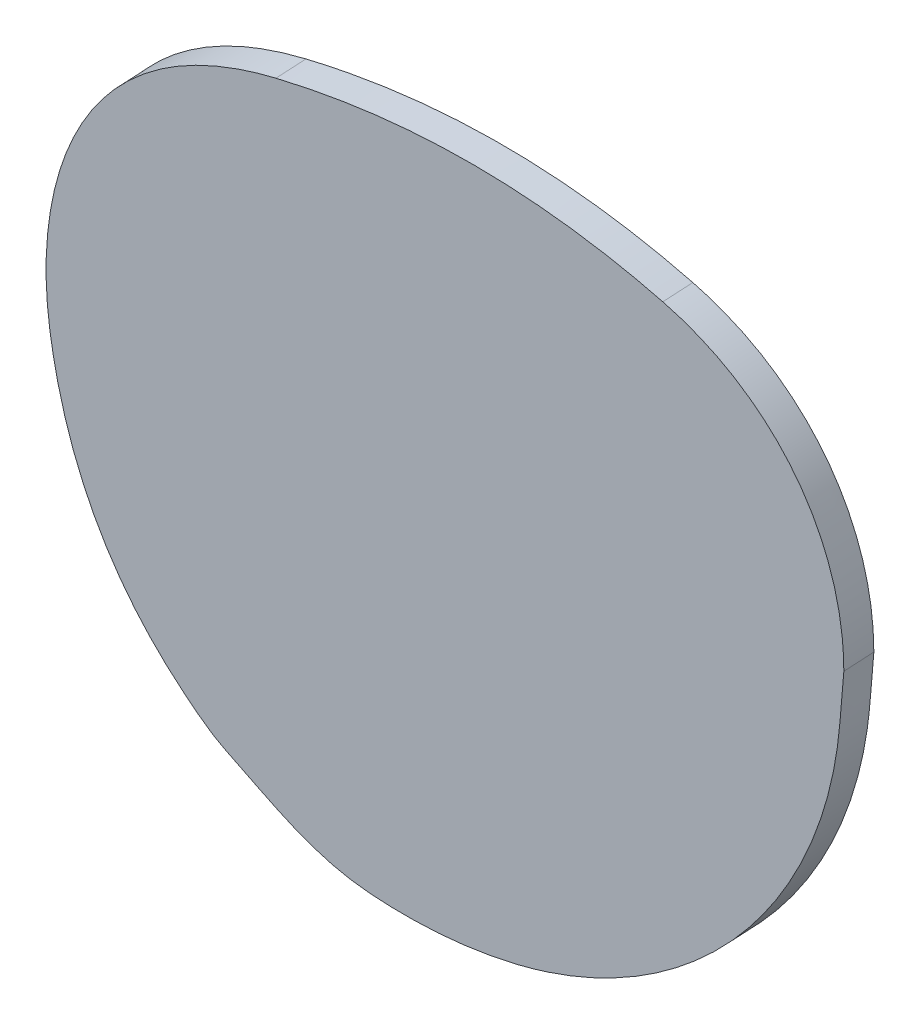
ISO-10303-21;
HEADER;
FILE_DESCRIPTION(('STEP AP214'),'2;1');
FILE_NAME('part.step','',(''),(''),'','','');
FILE_SCHEMA(('AUTOMOTIVE_DESIGN { 1 0 10303 214 1 1 1 1 }'));
ENDSEC;
DATA;
#1=APPLICATION_CONTEXT('core data for automotive mechanical design processes');
#2=APPLICATION_PROTOCOL_DEFINITION('international standard','automotive_design',2000,#1);
#3=PRODUCT_CONTEXT('',#1,'mechanical');
#4=PRODUCT('Part','Part','',(#3));
#5=PRODUCT_RELATED_PRODUCT_CATEGORY('part','',(#4));
#6=PRODUCT_DEFINITION_FORMATION('','',#4);
#7=PRODUCT_DEFINITION_CONTEXT('part definition',#1,'design');
#8=PRODUCT_DEFINITION('design','',#6,#7);
#9=PRODUCT_DEFINITION_SHAPE('','',#8);
#10=(LENGTH_UNIT() NAMED_UNIT(*) SI_UNIT(.MILLI.,.METRE.));
#11=(NAMED_UNIT(*) PLANE_ANGLE_UNIT() SI_UNIT($,.RADIAN.));
#12=(NAMED_UNIT(*) SI_UNIT($,.STERADIAN.) SOLID_ANGLE_UNIT());
#13=UNCERTAINTY_MEASURE_WITH_UNIT(LENGTH_MEASURE(1.E-05),#10,'distance_accuracy_value','');
#14=(GEOMETRIC_REPRESENTATION_CONTEXT(3) GLOBAL_UNCERTAINTY_ASSIGNED_CONTEXT((#13)) GLOBAL_UNIT_ASSIGNED_CONTEXT((#10,
#11,#12)) REPRESENTATION_CONTEXT('',''));
#15=CARTESIAN_POINT('',(0.,0.,0.));
#16=DIRECTION('',(0.,0.,1.));
#17=DIRECTION('',(1.,0.,0.));
#18=AXIS2_PLACEMENT_3D('',#15,#16,#17);
#19=CARTESIAN_POINT('',(7.15506768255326,38.680254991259,26.2106371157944));
#20=CARTESIAN_POINT('',(7.09653088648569,37.956999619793,26.2137048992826));
#21=CARTESIAN_POINT('',(7.04234312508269,37.2333962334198,26.2165447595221));
#22=CARTESIAN_POINT('',(6.92411421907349,35.786978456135,26.2227408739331));
#23=CARTESIAN_POINT('',(6.86452619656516,35.0631730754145,26.2258637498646));
#24=CARTESIAN_POINT('',(6.57291700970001,32.9069414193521,26.2411463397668));
#25=CARTESIAN_POINT('',(6.25309264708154,31.4881477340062,26.2579076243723));
#26=CARTESIAN_POINT('',(5.59562292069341,29.4207714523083,26.2923641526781));
#27=CARTESIAN_POINT('',(5.34564417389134,28.7382950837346,26.305464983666));
#28=CARTESIAN_POINT('',(4.79035545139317,27.4031020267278,26.3345664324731));
#29=CARTESIAN_POINT('',(4.48580010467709,26.7515285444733,26.3505275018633));
#30=CARTESIAN_POINT('',(3.493626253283,24.8435523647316,26.4025251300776));
#31=CARTESIAN_POINT('',(2.72815598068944,23.6335033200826,26.4426417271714));
#32=CARTESIAN_POINT('',(1.42096257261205,21.9130926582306,26.5111488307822));
#33=CARTESIAN_POINT('',(0.956286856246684,21.3532075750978,26.5355014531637));
#34=CARTESIAN_POINT('',(-0.0125046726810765,20.2840696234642,26.586273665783));
#35=CARTESIAN_POINT('',(-0.517345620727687,19.7733771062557,26.6127312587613));
#36=CARTESIAN_POINT('',(-2.09257338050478,18.3121924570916,26.6952854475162));
#37=CARTESIAN_POINT('',(-3.22313174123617,17.4319703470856,26.7545355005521));
#38=CARTESIAN_POINT('',(-4.74258388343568,16.4557793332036,26.8341666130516));
#39=CARTESIAN_POINT('',(-5.05258095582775,16.2663866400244,26.8504128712));
#40=CARTESIAN_POINT('',(-5.6779309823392,15.9036736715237,26.883186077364));
#41=CARTESIAN_POINT('',(-5.99364758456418,15.7300712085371,26.8997320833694));
#42=CARTESIAN_POINT('',(-6.94982901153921,15.2322884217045,26.9498434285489));
#43=CARTESIAN_POINT('',(-7.59930948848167,14.9310919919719,26.9838812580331));
#44=CARTESIAN_POINT('',(-9.58369493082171,14.1191359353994,27.0878784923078));
#45=CARTESIAN_POINT('',(-10.9542978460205,13.6993822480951,27.1597087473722));
#46=CARTESIAN_POINT('',(-12.3752312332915,13.4079376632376,27.2341767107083));
#47=B_SPLINE_CURVE_WITH_KNOTS('',3,(#19,#20,#21,#22,#23,#24,#25,#26,#27,#28,#29,#30,#31,#32,#33,
#34,#35,#36,#37,#38,#39,#40,#41,#42,#43,#44,#45,#46),.UNSPECIFIED.,.F.,.F.,(4,2,2,2,2,2,2,2,2,2,
2,2,2,4),(0.,0.0624999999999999,0.125,0.25,0.3125,0.375,0.5,0.5625,0.625,0.75,0.78125,0.8125,
0.875,1.),.UNSPECIFIED.);
#48=DIRECTION('',(0.0523359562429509,0.,0.998629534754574));
#49=VECTOR('',#48,1.);
#50=SURFACE_OF_LINEAR_EXTRUSION('',#47,#49);
#51=CARTESIAN_POINT('',(7.25973959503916,38.6802549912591,28.2078961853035));
#52=CARTESIAN_POINT('',(7.20120279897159,37.956999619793,28.2109639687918));
#53=CARTESIAN_POINT('',(7.14701503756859,37.2333962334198,28.2138038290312));
#54=CARTESIAN_POINT('',(7.02878613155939,35.786978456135,28.2199999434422));
#55=CARTESIAN_POINT('',(6.96919810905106,35.0631730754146,28.2231228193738));
#56=CARTESIAN_POINT('',(6.67758892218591,32.9069414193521,28.238405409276));
#57=CARTESIAN_POINT('',(6.35776455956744,31.4881477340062,28.2551666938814));
#58=CARTESIAN_POINT('',(5.70029483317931,29.4207714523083,28.2896232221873));
#59=CARTESIAN_POINT('',(5.45031608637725,28.7382950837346,28.3027240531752));
#60=CARTESIAN_POINT('',(4.89502736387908,27.4031020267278,28.3318255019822));
#61=CARTESIAN_POINT('',(4.59047201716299,26.7515285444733,28.3477865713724));
#62=CARTESIAN_POINT('',(3.5982981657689,24.8435523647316,28.3997841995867));
#63=CARTESIAN_POINT('',(2.83282789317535,23.6335033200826,28.4399007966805));
#64=CARTESIAN_POINT('',(1.52563448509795,21.9130926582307,28.5084079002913));
#65=CARTESIAN_POINT('',(1.06095876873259,21.3532075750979,28.5327605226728));
#66=CARTESIAN_POINT('',(0.0921672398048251,20.2840696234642,28.5835327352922));
#67=CARTESIAN_POINT('',(-0.412673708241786,19.7733771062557,28.6099903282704));
#68=CARTESIAN_POINT('',(-1.98790146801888,18.3121924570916,28.6925445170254));
#69=CARTESIAN_POINT('',(-3.11845982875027,17.4319703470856,28.7517945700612));
#70=CARTESIAN_POINT('',(-4.63791197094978,16.4557793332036,28.8314256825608));
#71=CARTESIAN_POINT('',(-4.94790904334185,16.2663866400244,28.8476719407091));
#72=CARTESIAN_POINT('',(-5.5732590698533,15.9036736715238,28.8804451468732));
#73=CARTESIAN_POINT('',(-5.88897567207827,15.7300712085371,28.8969911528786));
#74=CARTESIAN_POINT('',(-6.84515709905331,15.2322884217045,28.947102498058));
#75=CARTESIAN_POINT('',(-7.49463757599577,14.9310919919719,28.9811403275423));
#76=CARTESIAN_POINT('',(-9.4790230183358,14.1191359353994,29.0851375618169));
#77=CARTESIAN_POINT('',(-10.8496259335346,13.6993822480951,29.1569678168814));
#78=CARTESIAN_POINT('',(-12.2705593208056,13.4079376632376,29.2314357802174));
#79=B_SPLINE_CURVE_WITH_KNOTS('',3,(#51,#52,#53,#54,#55,#56,#57,#58,#59,#60,#61,#62,#63,#64,#65,
#66,#67,#68,#69,#70,#71,#72,#73,#74,#75,#76,#77,#78),.UNSPECIFIED.,.F.,.F.,(4,2,2,2,2,2,2,2,2,2,
2,2,2,4),(0.,0.0624999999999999,0.125,0.25,0.3125,0.375,0.5,0.5625,0.625,0.75,0.78125,0.8125,
0.875,1.),.UNSPECIFIED.);
#80=CARTESIAN_POINT('',(7.25973959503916,38.680254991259,28.2078961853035));
#81=VERTEX_POINT('',#80);
#82=CARTESIAN_POINT('',(-12.2705608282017,13.4079373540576,29.2314358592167));
#83=VERTEX_POINT('',#82);
#84=EDGE_CURVE('E384',#81,#83,#79,.T.);
#85=ORIENTED_EDGE('',*,*,#84,.T.);
#86=DIRECTION('',(0.0523359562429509,0.,0.998629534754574));
#87=VECTOR('',#86,1.);
#88=CARTESIAN_POINT('',(-12.3752327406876,13.4079373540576,27.2341767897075));
#89=LINE('',#88,#87);
#90=CARTESIAN_POINT('',(-12.3752327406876,13.4079373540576,27.2341767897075));
#91=VERTEX_POINT('',#90);
#92=EDGE_CURVE('E11',#91,#83,#89,.T.);
#93=ORIENTED_EDGE('',*,*,#92,.F.);
#94=CARTESIAN_POINT('',(-12.3752312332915,13.4079376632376,27.2341767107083));
#95=CARTESIAN_POINT('',(-10.9542978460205,13.6993822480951,27.1597087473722));
#96=CARTESIAN_POINT('',(-9.58369493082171,14.1191359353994,27.0878784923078));
#97=CARTESIAN_POINT('',(-7.59930948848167,14.9310919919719,26.9838812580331));
#98=CARTESIAN_POINT('',(-6.94982901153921,15.2322884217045,26.9498434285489));
#99=CARTESIAN_POINT('',(-5.99364758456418,15.7300712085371,26.8997320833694));
#100=CARTESIAN_POINT('',(-5.6779309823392,15.9036736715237,26.883186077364));
#101=CARTESIAN_POINT('',(-5.05258095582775,16.2663866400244,26.8504128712));
#102=CARTESIAN_POINT('',(-4.74258388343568,16.4557793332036,26.8341666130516));
#103=CARTESIAN_POINT('',(-3.22313174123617,17.4319703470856,26.7545355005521));
#104=CARTESIAN_POINT('',(-2.09257338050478,18.3121924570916,26.6952854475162));
#105=CARTESIAN_POINT('',(-0.517345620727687,19.7733771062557,26.6127312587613));
#106=CARTESIAN_POINT('',(-0.0125046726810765,20.2840696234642,26.586273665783));
#107=CARTESIAN_POINT('',(0.956286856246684,21.3532075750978,26.5355014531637));
#108=CARTESIAN_POINT('',(1.42096257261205,21.9130926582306,26.5111488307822));
#109=CARTESIAN_POINT('',(2.72815598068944,23.6335033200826,26.4426417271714));
#110=CARTESIAN_POINT('',(3.493626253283,24.8435523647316,26.4025251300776));
#111=CARTESIAN_POINT('',(4.48580010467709,26.7515285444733,26.3505275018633));
#112=CARTESIAN_POINT('',(4.79035545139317,27.4031020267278,26.3345664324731));
#113=CARTESIAN_POINT('',(5.34564417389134,28.7382950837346,26.305464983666));
#114=CARTESIAN_POINT('',(5.59562292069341,29.4207714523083,26.2923641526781));
#115=CARTESIAN_POINT('',(6.25309264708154,31.4881477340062,26.2579076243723));
#116=CARTESIAN_POINT('',(6.57291700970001,32.9069414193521,26.2411463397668));
#117=CARTESIAN_POINT('',(6.86452619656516,35.0631730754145,26.2258637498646));
#118=CARTESIAN_POINT('',(6.92411421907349,35.786978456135,26.2227408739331));
#119=CARTESIAN_POINT('',(7.04234312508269,37.2333962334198,26.2165447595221));
#120=CARTESIAN_POINT('',(7.09653088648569,37.956999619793,26.2137048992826));
#121=CARTESIAN_POINT('',(7.15506768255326,38.680254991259,26.2106371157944));
#122=B_SPLINE_CURVE_WITH_KNOTS('',3,(#94,#95,#96,#97,#98,#99,#100,#101,#102,#103,#104,#105,#106,
#107,#108,#109,#110,#111,#112,#113,#114,#115,#116,#117,#118,#119,#120,#121),.UNSPECIFIED.,.F.,
.F.,(4,2,2,2,2,2,2,2,2,2,2,2,2,4),(0.,0.125,0.1875,0.21875,0.25,0.375,0.4375,0.5,0.625,0.6875,
0.75,0.875,0.9375,1.),.UNSPECIFIED.);
#123=CARTESIAN_POINT('',(7.15506768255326,38.680254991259,26.2106371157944));
#124=VERTEX_POINT('',#123);
#125=EDGE_CURVE('E409',#124,#91,#122,.F.);
#126=ORIENTED_EDGE('',*,*,#125,.F.);
#127=DIRECTION('',(0.0523359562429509,0.,0.998629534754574));
#128=VECTOR('',#127,1.);
#129=CARTESIAN_POINT('',(7.15506768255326,38.680254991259,26.2106371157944));
#130=LINE('',#129,#128);
#131=EDGE_CURVE('E346',#124,#81,#130,.T.);
#132=ORIENTED_EDGE('',*,*,#131,.T.);
#133=EDGE_LOOP('',(#85,#93,#126,#132));
#134=FACE_BOUND('',#133,.T.);
#135=ADVANCED_FACE('F45',(#134),#50,.F.);
#136=CARTESIAN_POINT('',(-12.3752327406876,13.4079373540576,27.2341767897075));
#137=CARTESIAN_POINT('',(-13.83316348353,13.1089019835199,27.3105837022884));
#138=CARTESIAN_POINT('',(-15.309564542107,12.9358962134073,27.3879586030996));
#139=CARTESIAN_POINT('',(-18.2821948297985,12.8341997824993,27.543747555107));
#140=CARTESIAN_POINT('',(-19.7713232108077,12.9064233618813,27.6217894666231));
#141=CARTESIAN_POINT('',(-21.246541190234,13.102112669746,27.6991023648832));
#142=B_SPLINE_CURVE_WITH_KNOTS('',3,(#136,#137,#138,#139,#140,#141),.UNSPECIFIED.,.F.,.F.,(4,2,
4),(0.,0.5,1.),.UNSPECIFIED.);
#143=DIRECTION('',(0.0523359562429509,0.,0.998629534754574));
#144=VECTOR('',#143,1.);
#145=SURFACE_OF_LINEAR_EXTRUSION('',#142,#144);
#146=CARTESIAN_POINT('',(-12.2705608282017,13.4079373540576,29.2314358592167));
#147=CARTESIAN_POINT('',(-13.7284915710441,13.1089019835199,29.3078427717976));
#148=CARTESIAN_POINT('',(-15.2048926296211,12.9358962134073,29.3852176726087));
#149=CARTESIAN_POINT('',(-18.1775229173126,12.8341997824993,29.5410066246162));
#150=CARTESIAN_POINT('',(-19.6666512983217,12.9064233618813,29.6190485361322));
#151=CARTESIAN_POINT('',(-21.1418692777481,13.1021126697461,29.6963614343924));
#152=B_SPLINE_CURVE_WITH_KNOTS('',3,(#146,#147,#148,#149,#150,#151),.UNSPECIFIED.,.F.,.F.,(4,2,
4),(0.,0.5,1.),.UNSPECIFIED.);
#153=CARTESIAN_POINT('',(-21.1418700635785,13.102112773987,29.696361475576));
#154=VERTEX_POINT('',#153);
#155=EDGE_CURVE('E378',#83,#154,#152,.T.);
#156=ORIENTED_EDGE('',*,*,#155,.T.);
#157=DIRECTION('',(0.0523359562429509,0.,0.998629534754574));
#158=VECTOR('',#157,1.);
#159=CARTESIAN_POINT('',(-21.2465419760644,13.102112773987,27.6991024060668));
#160=LINE('',#159,#158);
#161=CARTESIAN_POINT('',(-21.2465419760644,13.102112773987,27.6991024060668));
#162=VERTEX_POINT('',#161);
#163=EDGE_CURVE('E59',#162,#154,#160,.T.);
#164=ORIENTED_EDGE('',*,*,#163,.F.);
#165=CARTESIAN_POINT('',(-21.246541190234,13.102112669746,27.6991023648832));
#166=CARTESIAN_POINT('',(-19.7713232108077,12.9064233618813,27.6217894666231));
#167=CARTESIAN_POINT('',(-18.2821948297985,12.8341997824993,27.543747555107));
#168=CARTESIAN_POINT('',(-15.309564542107,12.9358962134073,27.3879586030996));
#169=CARTESIAN_POINT('',(-13.83316348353,13.1089019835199,27.3105837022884));
#170=CARTESIAN_POINT('',(-12.3752327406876,13.4079373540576,27.2341767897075));
#171=B_SPLINE_CURVE_WITH_KNOTS('',3,(#165,#166,#167,#168,#169,#170),.UNSPECIFIED.,.F.,.F.,(4,2,
4),(0.,0.5,1.),.UNSPECIFIED.);
#172=EDGE_CURVE('E114',#91,#162,#171,.F.);
#173=ORIENTED_EDGE('',*,*,#172,.F.);
#174=ORIENTED_EDGE('',*,*,#92,.T.);
#175=EDGE_LOOP('',(#156,#164,#173,#174));
#176=FACE_BOUND('',#175,.T.);
#177=ADVANCED_FACE('F251',(#176),#145,.F.);
#178=CARTESIAN_POINT('',(-21.2465419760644,13.102112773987,27.6991024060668));
#179=CARTESIAN_POINT('',(-22.0384614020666,13.2071611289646,27.7406051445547));
#180=CARTESIAN_POINT('',(-22.8102589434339,13.3834656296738,27.7810533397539));
#181=CARTESIAN_POINT('',(-24.3161496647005,13.8695943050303,27.8599737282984));
#182=CARTESIAN_POINT('',(-25.0528569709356,14.1808648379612,27.8985829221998));
#183=CARTESIAN_POINT('',(-26.483225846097,14.8811720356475,27.9735453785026));
#184=CARTESIAN_POINT('',(-27.1793045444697,15.2692950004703,28.0100253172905));
#185=CARTESIAN_POINT('',(-28.5618275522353,16.0626473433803,28.0824802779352));
#186=CARTESIAN_POINT('',(-29.2484362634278,16.4674482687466,28.1184639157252));
#187=CARTESIAN_POINT('',(-29.9432760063,16.8578760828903,28.1548789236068));
#188=B_SPLINE_CURVE_WITH_KNOTS('',3,(#178,#179,#180,#181,#182,#183,#184,#185,#186,#187),
.UNSPECIFIED.,.F.,.F.,(4,2,2,2,4),(0.,0.25,0.5,0.75,1.),.UNSPECIFIED.);
#189=DIRECTION('',(0.0523359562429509,0.,0.998629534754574));
#190=VECTOR('',#189,1.);
#191=SURFACE_OF_LINEAR_EXTRUSION('',#188,#190);
#192=CARTESIAN_POINT('',(-21.1418700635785,13.102112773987,29.696361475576));
#193=CARTESIAN_POINT('',(-21.9337894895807,13.2071611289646,29.7378642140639));
#194=CARTESIAN_POINT('',(-22.705587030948,13.3834656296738,29.778312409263));
#195=CARTESIAN_POINT('',(-24.2114777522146,13.8695943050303,29.8572327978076));
#196=CARTESIAN_POINT('',(-24.9481850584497,14.1808648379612,29.8958419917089));
#197=CARTESIAN_POINT('',(-26.3785539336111,14.8811720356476,29.9708044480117));
#198=CARTESIAN_POINT('',(-27.0746326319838,15.2692950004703,30.0072843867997));
#199=CARTESIAN_POINT('',(-28.4571556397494,16.0626473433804,30.0797393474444));
#200=CARTESIAN_POINT('',(-29.1437643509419,16.4674482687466,30.1157229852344));
#201=CARTESIAN_POINT('',(-29.8386040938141,16.8578760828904,30.1521379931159));
#202=B_SPLINE_CURVE_WITH_KNOTS('',3,(#192,#193,#194,#195,#196,#197,#198,#199,#200,#201),
.UNSPECIFIED.,.F.,.F.,(4,2,2,2,4),(0.,0.25,0.5,0.75,1.),.UNSPECIFIED.);
#203=CARTESIAN_POINT('',(-29.8386040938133,16.8578760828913,30.1521379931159));
#204=VERTEX_POINT('',#203);
#205=EDGE_CURVE('E337',#154,#204,#202,.T.);
#206=ORIENTED_EDGE('',*,*,#205,.T.);
#207=DIRECTION('',(0.0523359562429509,0.,0.998629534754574));
#208=VECTOR('',#207,1.);
#209=CARTESIAN_POINT('',(-29.9432760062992,16.8578760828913,28.1548789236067));
#210=LINE('',#209,#208);
#211=CARTESIAN_POINT('',(-29.9432760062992,16.8578760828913,28.1548789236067));
#212=VERTEX_POINT('',#211);
#213=EDGE_CURVE('E336',#212,#204,#210,.T.);
#214=ORIENTED_EDGE('',*,*,#213,.F.);
#215=CARTESIAN_POINT('',(-29.9432760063,16.8578760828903,28.1548789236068));
#216=CARTESIAN_POINT('',(-29.2484362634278,16.4674482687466,28.1184639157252));
#217=CARTESIAN_POINT('',(-28.5618275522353,16.0626473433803,28.0824802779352));
#218=CARTESIAN_POINT('',(-27.1793045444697,15.2692950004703,28.0100253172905));
#219=CARTESIAN_POINT('',(-26.483225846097,14.8811720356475,27.9735453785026));
#220=CARTESIAN_POINT('',(-25.0528569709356,14.1808648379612,27.8985829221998));
#221=CARTESIAN_POINT('',(-24.3161496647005,13.8695943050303,27.8599737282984));
#222=CARTESIAN_POINT('',(-22.8102589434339,13.3834656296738,27.7810533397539));
#223=CARTESIAN_POINT('',(-22.0384614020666,13.2071611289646,27.7406051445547));
#224=CARTESIAN_POINT('',(-21.2465419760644,13.102112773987,27.6991024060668));
#225=B_SPLINE_CURVE_WITH_KNOTS('',3,(#215,#216,#217,#218,#219,#220,#221,#222,#223,#224),
.UNSPECIFIED.,.F.,.F.,(4,2,2,2,4),(0.,0.25,0.5,0.75,1.),.UNSPECIFIED.);
#226=EDGE_CURVE('E327',#162,#212,#225,.F.);
#227=ORIENTED_EDGE('',*,*,#226,.F.);
#228=ORIENTED_EDGE('',*,*,#163,.T.);
#229=EDGE_LOOP('',(#206,#214,#227,#228));
#230=FACE_BOUND('',#229,.T.);
#231=ADVANCED_FACE('F261',(#230),#191,.F.);
#232=CARTESIAN_POINT('',(-29.9432760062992,16.8578760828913,28.1548789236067));
#233=CARTESIAN_POINT('',(-30.3973348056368,17.1130110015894,28.1786751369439));
#234=CARTESIAN_POINT('',(-30.8160744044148,17.4215781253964,28.2006203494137));
#235=CARTESIAN_POINT('',(-31.6210371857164,18.080232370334,28.2428066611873));
#236=CARTESIAN_POINT('',(-32.0061062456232,18.4303772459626,28.2629872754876));
#237=CARTESIAN_POINT('',(-32.3902835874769,18.7810849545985,28.283121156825));
#238=B_SPLINE_CURVE_WITH_KNOTS('',3,(#232,#233,#234,#235,#236,#237),.UNSPECIFIED.,.F.,.F.,(4,2,
4),(0.,0.5,1.),.UNSPECIFIED.);
#239=DIRECTION('',(0.0523359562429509,0.,0.998629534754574));
#240=VECTOR('',#239,1.);
#241=SURFACE_OF_LINEAR_EXTRUSION('',#238,#240);
#242=CARTESIAN_POINT('',(-29.8386040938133,16.8578760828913,30.1521379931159));
#243=CARTESIAN_POINT('',(-30.2926628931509,17.1130110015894,30.1759342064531));
#244=CARTESIAN_POINT('',(-30.7114024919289,17.4215781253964,30.1978794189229));
#245=CARTESIAN_POINT('',(-31.5163652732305,18.080232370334,30.2400657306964));
#246=CARTESIAN_POINT('',(-31.9014343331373,18.4303772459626,30.2602463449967));
#247=CARTESIAN_POINT('',(-32.285611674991,18.7810849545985,30.2803802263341));
#248=B_SPLINE_CURVE_WITH_KNOTS('',3,(#242,#243,#244,#245,#246,#247),.UNSPECIFIED.,.F.,.F.,(4,2,
4),(0.,0.5,1.),.UNSPECIFIED.);
#249=CARTESIAN_POINT('',(-32.285611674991,18.7810849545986,30.2803802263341));
#250=VERTEX_POINT('',#249);
#251=EDGE_CURVE('E318',#204,#250,#248,.T.);
#252=ORIENTED_EDGE('',*,*,#251,.T.);
#253=DIRECTION('',(0.0523359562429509,0.,0.998629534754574));
#254=VECTOR('',#253,1.);
#255=CARTESIAN_POINT('',(-32.3902835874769,18.7810849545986,28.283121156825));
#256=LINE('',#255,#254);
#257=CARTESIAN_POINT('',(-32.3902835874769,18.7810849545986,28.283121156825));
#258=VERTEX_POINT('',#257);
#259=EDGE_CURVE('E340',#258,#250,#256,.T.);
#260=ORIENTED_EDGE('',*,*,#259,.F.);
#261=CARTESIAN_POINT('',(-32.3902835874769,18.7810849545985,28.283121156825));
#262=CARTESIAN_POINT('',(-32.0061062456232,18.4303772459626,28.2629872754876));
#263=CARTESIAN_POINT('',(-31.6210371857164,18.080232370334,28.2428066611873));
#264=CARTESIAN_POINT('',(-30.8160744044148,17.4215781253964,28.2006203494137));
#265=CARTESIAN_POINT('',(-30.3973348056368,17.1130110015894,28.1786751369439));
#266=CARTESIAN_POINT('',(-29.9432760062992,16.8578760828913,28.1548789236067));
#267=B_SPLINE_CURVE_WITH_KNOTS('',3,(#261,#262,#263,#264,#265,#266),.UNSPECIFIED.,.F.,.F.,(4,2,
4),(0.,0.5,1.),.UNSPECIFIED.);
#268=EDGE_CURVE('E330',#212,#258,#267,.F.);
#269=ORIENTED_EDGE('',*,*,#268,.F.);
#270=ORIENTED_EDGE('',*,*,#213,.T.);
#271=EDGE_LOOP('',(#252,#260,#269,#270));
#272=FACE_BOUND('',#271,.T.);
#273=ADVANCED_FACE('F291',(#272),#241,.F.);
#274=CARTESIAN_POINT('',(-32.3902835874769,18.7810849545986,28.283121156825));
#275=CARTESIAN_POINT('',(-32.9544725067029,19.2961179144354,28.3126890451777));
#276=CARTESIAN_POINT('',(-33.4930086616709,19.8348358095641,28.3409125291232));
#277=CARTESIAN_POINT('',(-34.5171401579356,20.9611513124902,28.3945849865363));
#278=CARTESIAN_POINT('',(-35.0040485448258,21.5505375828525,28.4201027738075));
#279=CARTESIAN_POINT('',(-36.3739142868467,23.3821577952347,28.4918943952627));
#280=CARTESIAN_POINT('',(-37.1550685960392,24.6714699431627,28.5328329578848));
#281=CARTESIAN_POINT('',(-38.146568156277,26.6985385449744,28.584795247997));
#282=CARTESIAN_POINT('',(-38.4470091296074,27.38975525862,28.6005406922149));
#283=CARTESIAN_POINT('',(-38.9905144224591,28.8018271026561,28.6290245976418));
#284=CARTESIAN_POINT('',(-39.2342363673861,29.5250709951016,28.6417975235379));
#285=CARTESIAN_POINT('',(-39.877924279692,31.7183770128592,28.6755317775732));
#286=CARTESIAN_POINT('',(-40.1904921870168,33.2068856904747,28.6919127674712));
#287=CARTESIAN_POINT('',(-40.4076147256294,34.7169344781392,28.7032916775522));
#288=B_SPLINE_CURVE_WITH_KNOTS('',3,(#274,#275,#276,#277,#278,#279,#280,#281,#282,#283,#284,
#285,#286,#287),.UNSPECIFIED.,.F.,.F.,(4,2,2,2,2,2,4),(0.,0.125,0.25,0.499999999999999,
0.624999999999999,0.749999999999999,1.),.UNSPECIFIED.);
#289=DIRECTION('',(0.0523359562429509,0.,0.998629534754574));
#290=VECTOR('',#289,1.);
#291=SURFACE_OF_LINEAR_EXTRUSION('',#288,#290);
#292=CARTESIAN_POINT('',(-32.285611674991,18.7810849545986,30.2803802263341));
#293=CARTESIAN_POINT('',(-32.849800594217,19.2961179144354,30.3099481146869));
#294=CARTESIAN_POINT('',(-33.388336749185,19.8348358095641,30.3381715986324));
#295=CARTESIAN_POINT('',(-34.4124682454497,20.9611513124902,30.3918440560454));
#296=CARTESIAN_POINT('',(-34.8993766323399,21.5505375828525,30.4173618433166));
#297=CARTESIAN_POINT('',(-36.2692423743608,23.3821577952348,30.4891534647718));
#298=CARTESIAN_POINT('',(-37.0503966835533,24.6714699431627,30.530092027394));
#299=CARTESIAN_POINT('',(-38.0418962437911,26.6985385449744,30.5820543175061));
#300=CARTESIAN_POINT('',(-38.3423372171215,27.38975525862,30.597799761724));
#301=CARTESIAN_POINT('',(-38.8858425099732,28.8018271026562,30.6262836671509));
#302=CARTESIAN_POINT('',(-39.1295644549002,29.5250709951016,30.6390565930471));
#303=CARTESIAN_POINT('',(-39.7732523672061,31.7183770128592,30.6727908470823));
#304=CARTESIAN_POINT('',(-40.0858202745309,33.2068856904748,30.6891718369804));
#305=CARTESIAN_POINT('',(-40.3029428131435,34.7169344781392,30.7005507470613));
#306=B_SPLINE_CURVE_WITH_KNOTS('',3,(#292,#293,#294,#295,#296,#297,#298,#299,#300,#301,#302,
#303,#304,#305),.UNSPECIFIED.,.F.,.F.,(4,2,2,2,2,2,4),(0.,0.125,0.25,0.499999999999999,
0.624999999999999,0.749999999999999,1.),.UNSPECIFIED.);
#307=CARTESIAN_POINT('',(-40.3029428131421,34.7169344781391,30.7005507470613));
#308=VERTEX_POINT('',#307);
#309=EDGE_CURVE('E383',#250,#308,#306,.T.);
#310=ORIENTED_EDGE('',*,*,#309,.T.);
#311=DIRECTION('',(0.0523359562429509,0.,0.998629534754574));
#312=VECTOR('',#311,1.);
#313=CARTESIAN_POINT('',(-40.407614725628,34.716934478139,28.7032916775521));
#314=LINE('',#313,#312);
#315=CARTESIAN_POINT('',(-40.407614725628,34.716934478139,28.7032916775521));
#316=VERTEX_POINT('',#315);
#317=EDGE_CURVE('E151',#316,#308,#314,.T.);
#318=ORIENTED_EDGE('',*,*,#317,.F.);
#319=CARTESIAN_POINT('',(-40.4076147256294,34.7169344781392,28.7032916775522));
#320=CARTESIAN_POINT('',(-40.1904921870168,33.2068856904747,28.6919127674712));
#321=CARTESIAN_POINT('',(-39.877924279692,31.7183770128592,28.6755317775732));
#322=CARTESIAN_POINT('',(-39.2342363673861,29.5250709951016,28.6417975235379));
#323=CARTESIAN_POINT('',(-38.9905144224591,28.8018271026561,28.6290245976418));
#324=CARTESIAN_POINT('',(-38.4470091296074,27.38975525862,28.6005406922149));
#325=CARTESIAN_POINT('',(-38.146568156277,26.6985385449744,28.584795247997));
#326=CARTESIAN_POINT('',(-37.1550685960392,24.6714699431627,28.5328329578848));
#327=CARTESIAN_POINT('',(-36.3739142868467,23.3821577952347,28.4918943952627));
#328=CARTESIAN_POINT('',(-35.0040485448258,21.5505375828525,28.4201027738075));
#329=CARTESIAN_POINT('',(-34.5171401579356,20.9611513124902,28.3945849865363));
#330=CARTESIAN_POINT('',(-33.4930086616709,19.8348358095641,28.3409125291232));
#331=CARTESIAN_POINT('',(-32.9544725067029,19.2961179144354,28.3126890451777));
#332=CARTESIAN_POINT('',(-32.3902835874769,18.7810849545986,28.283121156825));
#333=B_SPLINE_CURVE_WITH_KNOTS('',3,(#319,#320,#321,#322,#323,#324,#325,#326,#327,#328,#329,
#330,#331,#332),.UNSPECIFIED.,.F.,.F.,(4,2,2,2,2,2,4),(0.,0.250000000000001,0.375000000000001,
0.500000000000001,0.75,0.875,1.),.UNSPECIFIED.);
#334=EDGE_CURVE('E136',#258,#316,#333,.F.);
#335=ORIENTED_EDGE('',*,*,#334,.F.);
#336=ORIENTED_EDGE('',*,*,#259,.T.);
#337=EDGE_LOOP('',(#310,#318,#335,#336));
#338=FACE_BOUND('',#337,.T.);
#339=ADVANCED_FACE('F294',(#338),#291,.F.);
#340=CARTESIAN_POINT('',(-40.407614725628,34.716934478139,28.7032916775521));
#341=CARTESIAN_POINT('',(-40.5700270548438,35.8464977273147,28.7118033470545));
#342=CARTESIAN_POINT('',(-40.6479187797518,36.9776089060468,28.7158854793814));
#343=CARTESIAN_POINT('',(-40.637099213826,38.6766136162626,28.7153184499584));
#344=CARTESIAN_POINT('',(-40.6119860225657,39.2433423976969,28.7140023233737));
#345=CARTESIAN_POINT('',(-40.5158776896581,40.3776402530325,28.7089654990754));
#346=CARTESIAN_POINT('',(-40.4446629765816,40.9450878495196,28.7052332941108));
#347=CARTESIAN_POINT('',(-40.1606385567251,42.6237052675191,28.690348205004));
#348=CARTESIAN_POINT('',(-39.8778319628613,43.7195153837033,28.6755269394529));
#349=CARTESIAN_POINT('',(-39.2892716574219,45.3223119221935,28.6446818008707));
#350=CARTESIAN_POINT('',(-39.0649908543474,45.8497602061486,28.6329277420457));
#351=CARTESIAN_POINT('',(-38.5666846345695,46.8674622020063,28.6068126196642));
#352=CARTESIAN_POINT('',(-38.0167811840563,47.8536090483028,28.5779934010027));
#353=CARTESIAN_POINT('',(-37.3592560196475,48.7739380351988,28.5435339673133));
#354=CARTESIAN_POINT('',(-36.6447691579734,49.6594311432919,28.5060892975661));
#355=CARTESIAN_POINT('',(-36.2587639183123,50.0841560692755,28.4858596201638));
#356=CARTESIAN_POINT('',(-35.0452588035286,51.2722109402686,28.4222625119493));
#357=CARTESIAN_POINT('',(-34.1531923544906,51.9619551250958,28.3755112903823));
#358=CARTESIAN_POINT('',(-32.6995888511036,52.8543280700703,28.2993311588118));
#359=CARTESIAN_POINT('',(-32.1962669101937,53.1272419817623,28.2729531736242));
#360=CARTESIAN_POINT('',(-31.1765046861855,53.6172809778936,28.2195097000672));
#361=CARTESIAN_POINT('',(-30.657208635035,53.8362522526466,28.1922945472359));
#362=CARTESIAN_POINT('',(-29.0742023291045,54.423671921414,28.1093327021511));
#363=CARTESIAN_POINT('',(-27.9855122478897,54.7230088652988,28.0522768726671));
#364=CARTESIAN_POINT('',(-26.8695180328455,54.946803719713,27.9937900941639));
#365=B_SPLINE_CURVE_WITH_KNOTS('',3,(#340,#341,#342,#343,#344,#345,#346,#347,#348,#349,#350,
#351,#352,#353,#354,#355,#356,#357,#358,#359,#360,#361,#362,#363,#364),.UNSPECIFIED.,.F.,.F.,(4,
2,2,2,2,2,1,2,2,2,2,2,4),(0.,0.125000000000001,0.187500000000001,0.250000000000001,
0.375000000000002,0.437500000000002,0.500000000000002,0.562500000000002,0.625000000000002,
0.750000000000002,0.812500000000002,0.875000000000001,1.),.UNSPECIFIED.);
#366=DIRECTION('',(0.0523359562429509,0.,0.998629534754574));
#367=VECTOR('',#366,1.);
#368=SURFACE_OF_LINEAR_EXTRUSION('',#365,#367);
#369=CARTESIAN_POINT('',(-40.3029428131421,34.7169344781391,30.7005507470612));
#370=CARTESIAN_POINT('',(-40.4653551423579,35.8464977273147,30.7090624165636));
#371=CARTESIAN_POINT('',(-40.5432468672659,36.9776089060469,30.7131445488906));
#372=CARTESIAN_POINT('',(-40.5324273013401,38.6766136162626,30.7125775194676));
#373=CARTESIAN_POINT('',(-40.5073141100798,39.2433423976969,30.7112613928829));
#374=CARTESIAN_POINT('',(-40.4112057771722,40.3776402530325,30.7062245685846));
#375=CARTESIAN_POINT('',(-40.3399910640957,40.9450878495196,30.70249236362));
#376=CARTESIAN_POINT('',(-40.0559666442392,42.6237052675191,30.6876072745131));
#377=CARTESIAN_POINT('',(-39.7731600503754,43.7195153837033,30.6727860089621));
#378=CARTESIAN_POINT('',(-39.184599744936,45.3223119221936,30.6419408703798));
#379=CARTESIAN_POINT('',(-38.9603189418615,45.8497602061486,30.6301868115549));
#380=CARTESIAN_POINT('',(-38.4620127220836,46.8674622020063,30.6040716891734));
#381=CARTESIAN_POINT('',(-37.9121092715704,47.8536090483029,30.5752524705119));
#382=CARTESIAN_POINT('',(-37.2545841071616,48.7739380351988,30.5407930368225));
#383=CARTESIAN_POINT('',(-36.5400972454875,49.6594311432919,30.5033483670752));
#384=CARTESIAN_POINT('',(-36.1540920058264,50.0841560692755,30.4831186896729));
#385=CARTESIAN_POINT('',(-34.9405868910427,51.2722109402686,30.4195215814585));
#386=CARTESIAN_POINT('',(-34.0485204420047,51.9619551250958,30.3727703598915));
#387=CARTESIAN_POINT('',(-32.5949169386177,52.8543280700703,30.2965902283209));
#388=CARTESIAN_POINT('',(-32.0915949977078,53.1272419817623,30.2702122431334));
#389=CARTESIAN_POINT('',(-31.0718327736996,53.6172809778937,30.2167687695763));
#390=CARTESIAN_POINT('',(-30.5525367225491,53.8362522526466,30.1895536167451));
#391=CARTESIAN_POINT('',(-28.9695304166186,54.423671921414,30.1065917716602));
#392=CARTESIAN_POINT('',(-27.8808403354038,54.7230088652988,30.0495359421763));
#393=CARTESIAN_POINT('',(-26.7648461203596,54.946803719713,29.9910491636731));
#394=B_SPLINE_CURVE_WITH_KNOTS('',3,(#369,#370,#371,#372,#373,#374,#375,#376,#377,#378,#379,
#380,#381,#382,#383,#384,#385,#386,#387,#388,#389,#390,#391,#392,#393),.UNSPECIFIED.,.F.,.F.,(4,
2,2,2,2,2,1,2,2,2,2,2,4),(0.,0.125000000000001,0.187500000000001,0.250000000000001,
0.375000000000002,0.437500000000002,0.500000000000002,0.562500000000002,0.625000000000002,
0.750000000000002,0.812500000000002,0.875000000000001,1.),.UNSPECIFIED.);
#395=CARTESIAN_POINT('',(-26.7648461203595,54.946803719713,29.9910491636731));
#396=VERTEX_POINT('',#395);
#397=EDGE_CURVE('E148',#308,#396,#394,.T.);
#398=ORIENTED_EDGE('',*,*,#397,.T.);
#399=DIRECTION('',(0.0523359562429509,0.,0.998629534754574));
#400=VECTOR('',#399,1.);
#401=CARTESIAN_POINT('',(-26.8695180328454,54.9468037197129,27.9937900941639));
#402=LINE('',#401,#400);
#403=CARTESIAN_POINT('',(-26.8695180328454,54.9468037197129,27.9937900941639));
#404=VERTEX_POINT('',#403);
#405=EDGE_CURVE('E145',#404,#396,#402,.T.);
#406=ORIENTED_EDGE('',*,*,#405,.F.);
#407=CARTESIAN_POINT('',(-26.8695180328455,54.946803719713,27.9937900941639));
#408=CARTESIAN_POINT('',(-27.9855122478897,54.7230088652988,28.0522768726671));
#409=CARTESIAN_POINT('',(-29.0742023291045,54.423671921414,28.1093327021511));
#410=CARTESIAN_POINT('',(-30.657208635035,53.8362522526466,28.1922945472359));
#411=CARTESIAN_POINT('',(-31.1765046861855,53.6172809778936,28.2195097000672));
#412=CARTESIAN_POINT('',(-32.1962669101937,53.1272419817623,28.2729531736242));
#413=CARTESIAN_POINT('',(-32.6995888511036,52.8543280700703,28.2993311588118));
#414=CARTESIAN_POINT('',(-34.1531923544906,51.9619551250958,28.3755112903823));
#415=CARTESIAN_POINT('',(-35.0452588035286,51.2722109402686,28.4222625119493));
#416=CARTESIAN_POINT('',(-36.2587639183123,50.0841560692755,28.4858596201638));
#417=CARTESIAN_POINT('',(-36.6447691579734,49.6594311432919,28.5060892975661));
#418=CARTESIAN_POINT('',(-37.3592560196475,48.7739380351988,28.5435339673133));
#419=CARTESIAN_POINT('',(-38.0167811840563,47.8536090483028,28.5779934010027));
#420=CARTESIAN_POINT('',(-38.5666846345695,46.8674622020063,28.6068126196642));
#421=CARTESIAN_POINT('',(-39.0649908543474,45.8497602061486,28.6329277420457));
#422=CARTESIAN_POINT('',(-39.2892716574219,45.3223119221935,28.6446818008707));
#423=CARTESIAN_POINT('',(-39.8778319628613,43.7195153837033,28.6755269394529));
#424=CARTESIAN_POINT('',(-40.1606385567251,42.6237052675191,28.690348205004));
#425=CARTESIAN_POINT('',(-40.4446629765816,40.9450878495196,28.7052332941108));
#426=CARTESIAN_POINT('',(-40.5158776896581,40.3776402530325,28.7089654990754));
#427=CARTESIAN_POINT('',(-40.6119860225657,39.2433423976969,28.7140023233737));
#428=CARTESIAN_POINT('',(-40.637099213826,38.6766136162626,28.7153184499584));
#429=CARTESIAN_POINT('',(-40.6479187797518,36.9776089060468,28.7158854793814));
#430=CARTESIAN_POINT('',(-40.5700270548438,35.8464977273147,28.7118033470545));
#431=CARTESIAN_POINT('',(-40.407614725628,34.716934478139,28.7032916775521));
#432=B_SPLINE_CURVE_WITH_KNOTS('',3,(#407,#408,#409,#410,#411,#412,#413,#414,#415,#416,#417,
#418,#419,#420,#421,#422,#423,#424,#425,#426,#427,#428,#429,#430,#431),.UNSPECIFIED.,.F.,.F.,(4,
2,2,2,2,2,1,2,2,2,2,2,4),(0.,0.124999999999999,0.187499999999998,0.249999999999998,
0.374999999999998,0.437499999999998,0.499999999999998,0.562499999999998,0.624999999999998,
0.749999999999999,0.812499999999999,0.874999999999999,1.),.UNSPECIFIED.);
#433=EDGE_CURVE('E128',#316,#404,#432,.F.);
#434=ORIENTED_EDGE('',*,*,#433,.F.);
#435=ORIENTED_EDGE('',*,*,#317,.T.);
#436=EDGE_LOOP('',(#398,#406,#434,#435));
#437=FACE_BOUND('',#436,.T.);
#438=ADVANCED_FACE('F146',(#437),#368,.F.);
#439=CARTESIAN_POINT('',(-26.8695180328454,54.9468037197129,27.9937900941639));
#440=CARTESIAN_POINT('',(-24.9469602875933,55.3323412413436,27.8930331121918));
#441=CARTESIAN_POINT('',(-23.0148079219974,55.6048532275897,27.7917732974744));
#442=CARTESIAN_POINT('',(-20.1011940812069,55.8323810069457,27.6390772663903));
#443=CARTESIAN_POINT('',(-19.1274233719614,55.8779947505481,27.5880441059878));
#444=CARTESIAN_POINT('',(-17.1745595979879,55.9065243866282,27.4856988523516));
#445=CARTESIAN_POINT('',(-16.1935269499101,55.8893147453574,27.4342851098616));
#446=CARTESIAN_POINT('',(-13.2576155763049,55.7409048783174,27.2804205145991));
#447=CARTESIAN_POINT('',(-11.3114826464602,55.5133424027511,27.1784280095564));
#448=CARTESIAN_POINT('',(-7.45485474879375,54.8017657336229,26.9763107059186));
#449=CARTESIAN_POINT('',(-5.55757632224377,54.3205206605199,26.8768785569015));
#450=CARTESIAN_POINT('',(-3.69000391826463,53.7191931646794,26.7790032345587));
#451=B_SPLINE_CURVE_WITH_KNOTS('',3,(#439,#440,#441,#442,#443,#444,#445,#446,#447,#448,#449,
#450),.UNSPECIFIED.,.F.,.F.,(4,2,2,2,2,4),(0.,0.25,0.374999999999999,0.499999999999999,0.75,1.),.UNSPECIFIED.);
#452=DIRECTION('',(0.0523359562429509,0.,0.998629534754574));
#453=VECTOR('',#452,1.);
#454=SURFACE_OF_LINEAR_EXTRUSION('',#451,#453);
#455=CARTESIAN_POINT('',(-26.7648461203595,54.946803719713,29.9910491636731));
#456=CARTESIAN_POINT('',(-24.8422883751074,55.3323412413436,29.890292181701));
#457=CARTESIAN_POINT('',(-22.9101360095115,55.6048532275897,29.7890323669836));
#458=CARTESIAN_POINT('',(-19.996522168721,55.8323810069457,29.6363363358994));
#459=CARTESIAN_POINT('',(-19.0227514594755,55.8779947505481,29.585303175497));
#460=CARTESIAN_POINT('',(-17.069887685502,55.9065243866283,29.4829579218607));
#461=CARTESIAN_POINT('',(-16.0888550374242,55.8893147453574,29.4315441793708));
#462=CARTESIAN_POINT('',(-13.152943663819,55.7409048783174,29.2776795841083));
#463=CARTESIAN_POINT('',(-11.2068107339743,55.5133424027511,29.1756870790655));
#464=CARTESIAN_POINT('',(-7.35018283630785,54.8017657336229,28.9735697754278));
#465=CARTESIAN_POINT('',(-5.45290440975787,54.32052066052,28.8741376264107));
#466=CARTESIAN_POINT('',(-3.58533200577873,53.7191931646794,28.7762623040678));
#467=B_SPLINE_CURVE_WITH_KNOTS('',3,(#455,#456,#457,#458,#459,#460,#461,#462,#463,#464,#465,
#466),.UNSPECIFIED.,.F.,.F.,(4,2,2,2,2,4),(0.,0.25,0.374999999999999,0.499999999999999,0.75,1.),.UNSPECIFIED.);
#468=CARTESIAN_POINT('',(-3.58533181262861,53.7191931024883,28.7762622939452));
#469=VERTEX_POINT('',#468);
#470=EDGE_CURVE('E98',#396,#469,#467,.T.);
#471=ORIENTED_EDGE('',*,*,#470,.T.);
#472=DIRECTION('',(0.0523359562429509,0.,0.998629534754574));
#473=VECTOR('',#472,1.);
#474=CARTESIAN_POINT('',(-3.69000372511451,53.7191931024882,26.7790032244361));
#475=LINE('',#474,#473);
#476=CARTESIAN_POINT('',(-3.69000372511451,53.7191931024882,26.7790032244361));
#477=VERTEX_POINT('',#476);
#478=EDGE_CURVE('E152',#477,#469,#475,.T.);
#479=ORIENTED_EDGE('',*,*,#478,.F.);
#480=CARTESIAN_POINT('',(-3.69000391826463,53.7191931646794,26.7790032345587));
#481=CARTESIAN_POINT('',(-5.55757632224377,54.3205206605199,26.8768785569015));
#482=CARTESIAN_POINT('',(-7.45485474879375,54.8017657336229,26.9763107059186));
#483=CARTESIAN_POINT('',(-11.3114826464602,55.5133424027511,27.1784280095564));
#484=CARTESIAN_POINT('',(-13.2576155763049,55.7409048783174,27.2804205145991));
#485=CARTESIAN_POINT('',(-16.1935269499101,55.8893147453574,27.4342851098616));
#486=CARTESIAN_POINT('',(-17.1745595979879,55.9065243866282,27.4856988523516));
#487=CARTESIAN_POINT('',(-19.1274233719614,55.8779947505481,27.5880441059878));
#488=CARTESIAN_POINT('',(-20.1011940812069,55.8323810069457,27.6390772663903));
#489=CARTESIAN_POINT('',(-23.0148079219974,55.6048532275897,27.7917732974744));
#490=CARTESIAN_POINT('',(-24.9469602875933,55.3323412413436,27.8930331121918));
#491=CARTESIAN_POINT('',(-26.8695180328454,54.9468037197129,27.9937900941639));
#492=B_SPLINE_CURVE_WITH_KNOTS('',3,(#480,#481,#482,#483,#484,#485,#486,#487,#488,#489,#490,
#491),.UNSPECIFIED.,.F.,.F.,(4,2,2,2,2,4),(0.,0.25,0.500000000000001,0.625000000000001,0.75,1.),.UNSPECIFIED.);
#493=EDGE_CURVE('E133',#404,#477,#492,.F.);
#494=ORIENTED_EDGE('',*,*,#493,.F.);
#495=ORIENTED_EDGE('',*,*,#405,.T.);
#496=EDGE_LOOP('',(#471,#479,#494,#495));
#497=FACE_BOUND('',#496,.T.);
#498=ADVANCED_FACE('F155',(#497),#454,.F.);
#499=CARTESIAN_POINT('',(-3.69000372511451,53.7191931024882,26.7790032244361));
#500=CARTESIAN_POINT('',(-2.89528695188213,53.4633075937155,26.737353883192));
#501=CARTESIAN_POINT('',(-2.125557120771,53.151937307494,26.6970140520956));
#502=CARTESIAN_POINT('',(-0.638700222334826,52.4123896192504,26.6190911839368));
#503=CARTESIAN_POINT('',(0.0820492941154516,51.980794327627,26.5813183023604));
#504=CARTESIAN_POINT('',(1.42764982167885,51.0190495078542,26.5107983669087));
#505=CARTESIAN_POINT('',(2.0571381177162,50.4874491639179,26.4778082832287));
#506=CARTESIAN_POINT('',(2.93503847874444,49.6123590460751,26.4317994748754));
#507=CARTESIAN_POINT('',(3.2165786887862,49.3076696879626,26.4170445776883));
#508=CARTESIAN_POINT('',(3.75673155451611,48.6714377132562,26.388736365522));
#509=CARTESIAN_POINT('',(4.01318998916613,48.3422448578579,26.3752959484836));
#510=CARTESIAN_POINT('',(4.7349250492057,47.3325181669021,26.3374714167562));
#511=CARTESIAN_POINT('',(5.15632333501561,46.6258516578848,26.3153868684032));
#512=CARTESIAN_POINT('',(5.7016960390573,45.5172125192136,26.2868050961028));
#513=CARTESIAN_POINT('',(5.86897514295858,45.1395272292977,26.2780383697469));
#514=CARTESIAN_POINT('',(6.17432749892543,44.3677766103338,26.2620355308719));
#515=CARTESIAN_POINT('',(6.31285489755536,43.9719507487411,26.2547756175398));
#516=CARTESIAN_POINT('',(6.92182990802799,41.9834591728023,26.2228605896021));
#517=CARTESIAN_POINT('',(7.15342025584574,40.3507238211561,26.2107234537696));
#518=CARTESIAN_POINT('',(7.15506768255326,38.680254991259,26.2106371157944));
#519=B_SPLINE_CURVE_WITH_KNOTS('',3,(#499,#500,#501,#502,#503,#504,#505,#506,#507,#508,#509,
#510,#511,#512,#513,#514,#515,#516,#517,#518),.UNSPECIFIED.,.F.,.F.,(4,2,2,2,2,2,2,2,2,4),(0.,
0.125,0.249999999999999,0.374999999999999,0.437499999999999,0.499999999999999,0.625,0.6875,0.75,
1.),.UNSPECIFIED.);
#520=DIRECTION('',(0.0523359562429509,0.,0.998629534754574));
#521=VECTOR('',#520,1.);
#522=SURFACE_OF_LINEAR_EXTRUSION('',#519,#521);
#523=CARTESIAN_POINT('',(-3.58533181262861,53.7191931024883,28.7762622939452));
#524=CARTESIAN_POINT('',(-2.79061503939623,53.4633075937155,28.7346129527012));
#525=CARTESIAN_POINT('',(-2.0208852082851,53.151937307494,28.6942731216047));
#526=CARTESIAN_POINT('',(-0.534028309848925,52.4123896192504,28.616350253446));
#527=CARTESIAN_POINT('',(0.186721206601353,51.980794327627,28.5785773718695));
#528=CARTESIAN_POINT('',(1.53232173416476,51.0190495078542,28.5080574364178));
#529=CARTESIAN_POINT('',(2.16181003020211,50.4874491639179,28.4750673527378));
#530=CARTESIAN_POINT('',(3.03971039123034,49.6123590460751,28.4290585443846));
#531=CARTESIAN_POINT('',(3.3212506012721,49.3076696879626,28.4143036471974));
#532=CARTESIAN_POINT('',(3.86140346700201,48.6714377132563,28.3859954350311));
#533=CARTESIAN_POINT('',(4.11786190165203,48.3422448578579,28.3725550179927));
#534=CARTESIAN_POINT('',(4.8395969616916,47.3325181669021,28.3347304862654));
#535=CARTESIAN_POINT('',(5.26099524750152,46.6258516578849,28.3126459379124));
#536=CARTESIAN_POINT('',(5.8063679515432,45.5172125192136,28.284064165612));
#537=CARTESIAN_POINT('',(5.97364705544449,45.1395272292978,28.2752974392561));
#538=CARTESIAN_POINT('',(6.27899941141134,44.3677766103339,28.259294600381));
#539=CARTESIAN_POINT('',(6.41752681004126,43.9719507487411,28.252034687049));
#540=CARTESIAN_POINT('',(7.02650182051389,41.9834591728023,28.2201196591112));
#541=CARTESIAN_POINT('',(7.25809216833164,40.3507238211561,28.2079825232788));
#542=CARTESIAN_POINT('',(7.25973959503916,38.680254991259,28.2078961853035));
#543=B_SPLINE_CURVE_WITH_KNOTS('',3,(#523,#524,#525,#526,#527,#528,#529,#530,#531,#532,#533,
#534,#535,#536,#537,#538,#539,#540,#541,#542),.UNSPECIFIED.,.F.,.F.,(4,2,2,2,2,2,2,2,2,4),(0.,
0.125,0.249999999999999,0.374999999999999,0.437499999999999,0.499999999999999,0.625,0.6875,0.75,
1.),.UNSPECIFIED.);
#544=EDGE_CURVE('E105',#469,#81,#543,.T.);
#545=ORIENTED_EDGE('',*,*,#544,.T.);
#546=ORIENTED_EDGE('',*,*,#131,.F.);
#547=CARTESIAN_POINT('',(7.15506768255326,38.680254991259,26.2106371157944));
#548=CARTESIAN_POINT('',(7.15342025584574,40.3507238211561,26.2107234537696));
#549=CARTESIAN_POINT('',(6.92182990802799,41.9834591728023,26.2228605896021));
#550=CARTESIAN_POINT('',(6.31285489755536,43.9719507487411,26.2547756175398));
#551=CARTESIAN_POINT('',(6.17432749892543,44.3677766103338,26.2620355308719));
#552=CARTESIAN_POINT('',(5.86897514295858,45.1395272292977,26.2780383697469));
#553=CARTESIAN_POINT('',(5.7016960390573,45.5172125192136,26.2868050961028));
#554=CARTESIAN_POINT('',(5.15632333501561,46.6258516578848,26.3153868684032));
#555=CARTESIAN_POINT('',(4.7349250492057,47.3325181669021,26.3374714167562));
#556=CARTESIAN_POINT('',(4.01318998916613,48.3422448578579,26.3752959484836));
#557=CARTESIAN_POINT('',(3.75673155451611,48.6714377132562,26.388736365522));
#558=CARTESIAN_POINT('',(3.2165786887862,49.3076696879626,26.4170445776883));
#559=CARTESIAN_POINT('',(2.93503847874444,49.6123590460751,26.4317994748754));
#560=CARTESIAN_POINT('',(2.0571381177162,50.4874491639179,26.4778082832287));
#561=CARTESIAN_POINT('',(1.42764982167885,51.0190495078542,26.5107983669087));
#562=CARTESIAN_POINT('',(0.0820492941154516,51.980794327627,26.5813183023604));
#563=CARTESIAN_POINT('',(-0.638700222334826,52.4123896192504,26.6190911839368));
#564=CARTESIAN_POINT('',(-2.125557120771,53.151937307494,26.6970140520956));
#565=CARTESIAN_POINT('',(-2.89528695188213,53.4633075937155,26.737353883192));
#566=CARTESIAN_POINT('',(-3.69000372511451,53.7191931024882,26.7790032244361));
#567=B_SPLINE_CURVE_WITH_KNOTS('',3,(#547,#548,#549,#550,#551,#552,#553,#554,#555,#556,#557,
#558,#559,#560,#561,#562,#563,#564,#565,#566),.UNSPECIFIED.,.F.,.F.,(4,2,2,2,2,2,2,2,2,4),(0.,
0.25,0.3125,0.375,0.500000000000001,0.562500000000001,0.625000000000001,0.750000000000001,0.875,
1.),.UNSPECIFIED.);
#568=EDGE_CURVE('E68',#477,#124,#567,.F.);
#569=ORIENTED_EDGE('',*,*,#568,.F.);
#570=ORIENTED_EDGE('',*,*,#478,.T.);
#571=EDGE_LOOP('',(#545,#546,#569,#570));
#572=FACE_BOUND('',#571,.T.);
#573=ADVANCED_FACE('F176',(#572),#522,.F.);
#574=CARTESIAN_POINT('',(1.85669370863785,22.4865628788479,26.4883131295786));
#575=DIRECTION('',(-0.0523359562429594,0.,-0.998629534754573));
#576=DIRECTION('',(-0.998629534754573,0.,0.0523359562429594));
#577=AXIS2_PLACEMENT_3D('',#574,#575,#576);
#578=PLANE('',#577);
#579=ORIENTED_EDGE('',*,*,#125,.T.);
#580=ORIENTED_EDGE('',*,*,#172,.T.);
#581=ORIENTED_EDGE('',*,*,#226,.T.);
#582=ORIENTED_EDGE('',*,*,#268,.T.);
#583=ORIENTED_EDGE('',*,*,#334,.T.);
#584=ORIENTED_EDGE('',*,*,#433,.T.);
#585=ORIENTED_EDGE('',*,*,#493,.T.);
#586=ORIENTED_EDGE('',*,*,#568,.T.);
#587=EDGE_LOOP('',(#579,#580,#581,#582,#583,#584,#585,#586));
#588=FACE_BOUND('',#587,.T.);
#589=ADVANCED_FACE('F131',(#588),#578,.T.);
#590=CARTESIAN_POINT('',(1.96136562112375,22.486562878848,28.4855721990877));
#591=DIRECTION('',(-0.0523359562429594,0.,-0.998629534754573));
#592=DIRECTION('',(-0.998629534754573,0.,0.0523359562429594));
#593=AXIS2_PLACEMENT_3D('',#590,#591,#592);
#594=PLANE('',#593);
#595=ORIENTED_EDGE('',*,*,#84,.F.);
#596=ORIENTED_EDGE('',*,*,#544,.F.);
#597=ORIENTED_EDGE('',*,*,#470,.F.);
#598=ORIENTED_EDGE('',*,*,#397,.F.);
#599=ORIENTED_EDGE('',*,*,#309,.F.);
#600=ORIENTED_EDGE('',*,*,#251,.F.);
#601=ORIENTED_EDGE('',*,*,#205,.F.);
#602=ORIENTED_EDGE('',*,*,#155,.F.);
#603=EDGE_LOOP('',(#595,#596,#597,#598,#599,#600,#601,#602));
#604=FACE_BOUND('',#603,.T.);
#605=ADVANCED_FACE('F211',(#604),#594,.F.);
#606=CLOSED_SHELL('',(#135,#177,#231,#273,#339,#438,#498,#573,#589,#605));
#607=MANIFOLD_SOLID_BREP('B2',#606);
#608=ADVANCED_BREP_SHAPE_REPRESENTATION('',(#18,#607),#14);
#609=SHAPE_DEFINITION_REPRESENTATION(#9,#608);
ENDSEC;
END-ISO-10303-21;
